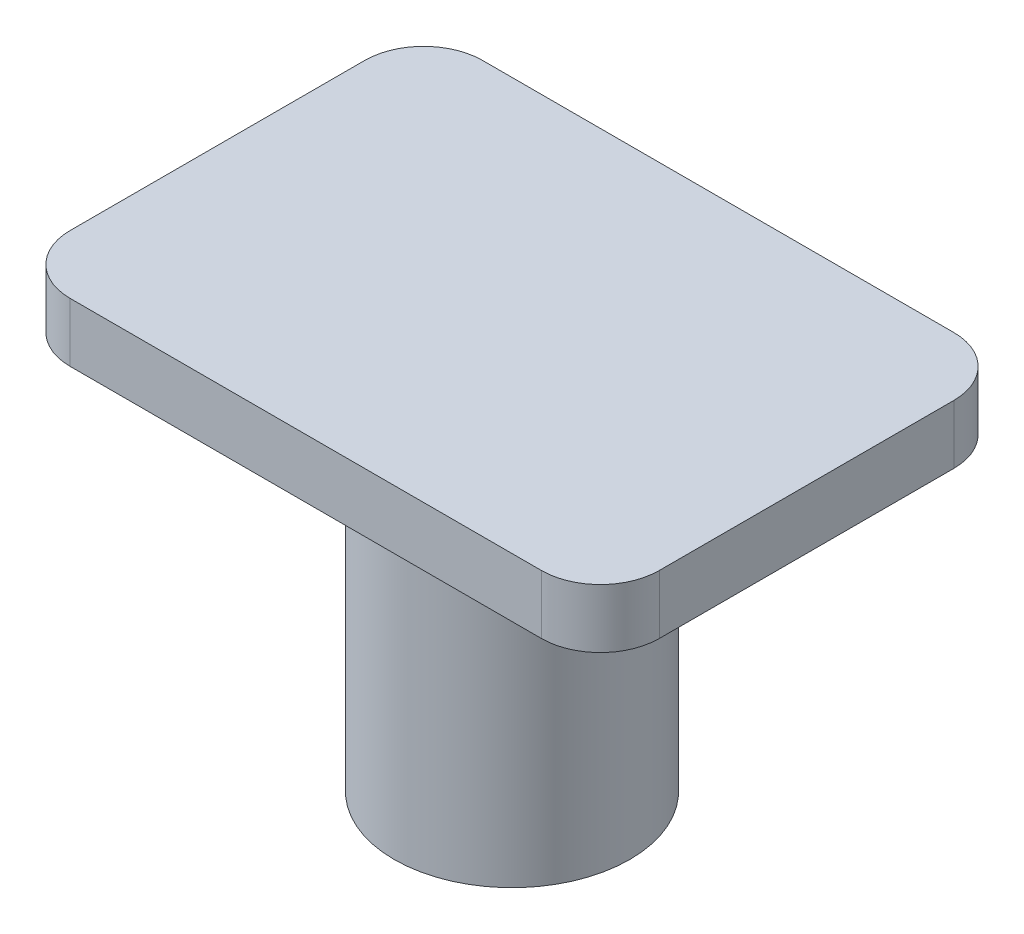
ISO-10303-21;
HEADER;
FILE_DESCRIPTION(('STEP AP214'),'2;1');
FILE_NAME('part.step','',(''),(''),'','','');
FILE_SCHEMA(('AUTOMOTIVE_DESIGN { 1 0 10303 214 1 1 1 1 }'));
ENDSEC;
DATA;
#1=APPLICATION_CONTEXT('core data for automotive mechanical design processes');
#2=APPLICATION_PROTOCOL_DEFINITION('international standard','automotive_design',2000,#1);
#3=PRODUCT_CONTEXT('',#1,'mechanical');
#4=PRODUCT('Part','Part','',(#3));
#5=PRODUCT_RELATED_PRODUCT_CATEGORY('part','',(#4));
#6=PRODUCT_DEFINITION_FORMATION('','',#4);
#7=PRODUCT_DEFINITION_CONTEXT('part definition',#1,'design');
#8=PRODUCT_DEFINITION('design','',#6,#7);
#9=PRODUCT_DEFINITION_SHAPE('','',#8);
#10=(LENGTH_UNIT() NAMED_UNIT(*) SI_UNIT(.MILLI.,.METRE.));
#11=(NAMED_UNIT(*) PLANE_ANGLE_UNIT() SI_UNIT($,.RADIAN.));
#12=(NAMED_UNIT(*) SI_UNIT($,.STERADIAN.) SOLID_ANGLE_UNIT());
#13=UNCERTAINTY_MEASURE_WITH_UNIT(LENGTH_MEASURE(1.E-05),#10,'distance_accuracy_value','');
#14=(GEOMETRIC_REPRESENTATION_CONTEXT(3) GLOBAL_UNCERTAINTY_ASSIGNED_CONTEXT((#13)) GLOBAL_UNIT_ASSIGNED_CONTEXT((#10,
#11,#12)) REPRESENTATION_CONTEXT('',''));
#15=CARTESIAN_POINT('',(0.,0.,0.));
#16=DIRECTION('',(0.,0.,1.));
#17=DIRECTION('',(1.,0.,0.));
#18=AXIS2_PLACEMENT_3D('',#15,#16,#17);
#19=CARTESIAN_POINT('',(0.,0.,0.));
#20=DIRECTION('',(0.,1.,0.));
#21=DIRECTION('',(0.,0.,1.));
#22=AXIS2_PLACEMENT_3D('',#19,#20,#21);
#23=PLANE('',#22);
#24=CARTESIAN_POINT('',(0.,0.,0.));
#25=DIRECTION('',(0.,1.,0.));
#26=DIRECTION('',(0.,0.,1.));
#27=AXIS2_PLACEMENT_3D('',#24,#25,#26);
#28=CIRCLE('',#27,10.);
#29=CARTESIAN_POINT('',(0.,0.,10.));
#30=VERTEX_POINT('',#29);
#31=EDGE_CURVE('E154',#30,#30,#28,.T.);
#32=ORIENTED_EDGE('',*,*,#31,.F.);
#33=EDGE_LOOP('',(#32));
#34=FACE_BOUND('',#33,.T.);
#35=CARTESIAN_POINT('',(0.,0.,0.));
#36=DIRECTION('',(0.,1.,0.));
#37=DIRECTION('',(1.,0.,0.));
#38=AXIS2_PLACEMENT_3D('',#35,#36,#37);
#39=CIRCLE('',#38,8.);
#40=CARTESIAN_POINT('',(8.,0.,0.));
#41=VERTEX_POINT('',#40);
#42=EDGE_CURVE('E151',#41,#41,#39,.T.);
#43=ORIENTED_EDGE('',*,*,#42,.T.);
#44=EDGE_LOOP('',(#43));
#45=FACE_BOUND('',#44,.T.);
#46=ADVANCED_FACE('F39',(#34,#45),#23,.F.);
#47=CARTESIAN_POINT('',(0.,30.,0.));
#48=DIRECTION('',(0.,-1.,0.));
#49=DIRECTION('',(0.,0.,-1.));
#50=AXIS2_PLACEMENT_3D('',#47,#48,#49);
#51=CYLINDRICAL_SURFACE('',#50,10.);
#52=CARTESIAN_POINT('',(0.,30.,0.));
#53=DIRECTION('',(0.,1.,0.));
#54=DIRECTION('',(0.,0.,1.));
#55=AXIS2_PLACEMENT_3D('',#52,#53,#54);
#56=CIRCLE('',#55,10.);
#57=CARTESIAN_POINT('',(0.,30.,10.));
#58=VERTEX_POINT('',#57);
#59=EDGE_CURVE('E157',#58,#58,#56,.T.);
#60=ORIENTED_EDGE('',*,*,#59,.F.);
#61=EDGE_LOOP('',(#60));
#62=FACE_BOUND('',#61,.T.);
#63=ORIENTED_EDGE('',*,*,#31,.T.);
#64=EDGE_LOOP('',(#63));
#65=FACE_BOUND('',#64,.T.);
#66=ADVANCED_FACE('F41',(#62,#65),#51,.T.);
#67=CARTESIAN_POINT('',(0.,30.,0.));
#68=DIRECTION('',(0.,-1.,0.));
#69=DIRECTION('',(0.,0.,-1.));
#70=AXIS2_PLACEMENT_3D('',#67,#68,#69);
#71=CYLINDRICAL_SURFACE('',#70,8.);
#72=CARTESIAN_POINT('',(0.,30.,0.));
#73=DIRECTION('',(0.,1.,0.));
#74=DIRECTION('',(0.,0.,1.));
#75=AXIS2_PLACEMENT_3D('',#72,#73,#74);
#76=CIRCLE('',#75,8.);
#77=CARTESIAN_POINT('',(0.,30.,8.));
#78=VERTEX_POINT('',#77);
#79=EDGE_CURVE('E148',#78,#78,#76,.T.);
#80=ORIENTED_EDGE('',*,*,#79,.T.);
#81=EDGE_LOOP('',(#80));
#82=FACE_BOUND('',#81,.T.);
#83=ORIENTED_EDGE('',*,*,#42,.F.);
#84=EDGE_LOOP('',(#83));
#85=FACE_BOUND('',#84,.T.);
#86=ADVANCED_FACE('F214',(#82,#85),#71,.F.);
#87=CARTESIAN_POINT('',(-25.,30.,17.5));
#88=DIRECTION('',(0.,1.,0.));
#89=DIRECTION('',(0.,0.,1.));
#90=AXIS2_PLACEMENT_3D('',#87,#88,#89);
#91=PLANE('',#90);
#92=ORIENTED_EDGE('',*,*,#79,.F.);
#93=EDGE_LOOP('',(#92));
#94=FACE_BOUND('',#93,.T.);
#95=ADVANCED_FACE('F221',(#94),#91,.F.);
#96=DIRECTION('',(-1.,0.,0.));
#97=VECTOR('',#96,1.);
#98=CARTESIAN_POINT('',(-25.,30.,-17.5));
#99=LINE('',#98,#97);
#100=CARTESIAN_POINT('',(20.,30.,-17.5));
#101=VERTEX_POINT('',#100);
#102=CARTESIAN_POINT('',(-20.,30.,-17.5));
#103=VERTEX_POINT('',#102);
#104=EDGE_CURVE('E123',#101,#103,#99,.T.);
#105=ORIENTED_EDGE('',*,*,#104,.F.);
#106=CARTESIAN_POINT('',(20.,30.,-12.5));
#107=DIRECTION('',(0.,1.,0.));
#108=DIRECTION('',(0.,0.,1.));
#109=AXIS2_PLACEMENT_3D('',#106,#107,#108);
#110=CIRCLE('',#109,5.);
#111=CARTESIAN_POINT('',(25.,30.,-12.5));
#112=VERTEX_POINT('',#111);
#113=EDGE_CURVE('E106',#101,#112,#110,.F.);
#114=ORIENTED_EDGE('',*,*,#113,.T.);
#115=DIRECTION('',(0.,0.,-1.));
#116=VECTOR('',#115,1.);
#117=CARTESIAN_POINT('',(25.,30.,-17.5));
#118=LINE('',#117,#116);
#119=CARTESIAN_POINT('',(25.,30.,12.5));
#120=VERTEX_POINT('',#119);
#121=EDGE_CURVE('E135',#120,#112,#118,.T.);
#122=ORIENTED_EDGE('',*,*,#121,.F.);
#123=CARTESIAN_POINT('',(20.,30.,12.5));
#124=DIRECTION('',(0.,1.,0.));
#125=DIRECTION('',(0.,0.,1.));
#126=AXIS2_PLACEMENT_3D('',#123,#124,#125);
#127=CIRCLE('',#126,5.);
#128=CARTESIAN_POINT('',(20.,30.,17.5));
#129=VERTEX_POINT('',#128);
#130=EDGE_CURVE('E117',#120,#129,#127,.F.);
#131=ORIENTED_EDGE('',*,*,#130,.T.);
#132=DIRECTION('',(1.,0.,0.));
#133=VECTOR('',#132,1.);
#134=CARTESIAN_POINT('',(-25.,30.,17.5));
#135=LINE('',#134,#133);
#136=CARTESIAN_POINT('',(-20.,30.,17.5));
#137=VERTEX_POINT('',#136);
#138=EDGE_CURVE('E139',#137,#129,#135,.T.);
#139=ORIENTED_EDGE('',*,*,#138,.F.);
#140=CARTESIAN_POINT('',(-20.,30.,12.5));
#141=DIRECTION('',(0.,1.,0.));
#142=DIRECTION('',(0.,0.,1.));
#143=AXIS2_PLACEMENT_3D('',#140,#141,#142);
#144=CIRCLE('',#143,5.);
#145=CARTESIAN_POINT('',(-25.,30.,12.5));
#146=VERTEX_POINT('',#145);
#147=EDGE_CURVE('E127',#137,#146,#144,.F.);
#148=ORIENTED_EDGE('',*,*,#147,.T.);
#149=DIRECTION('',(0.,0.,1.));
#150=VECTOR('',#149,1.);
#151=CARTESIAN_POINT('',(-25.,30.,-17.5));
#152=LINE('',#151,#150);
#153=CARTESIAN_POINT('',(-25.,30.,-12.5));
#154=VERTEX_POINT('',#153);
#155=EDGE_CURVE('E183',#154,#146,#152,.T.);
#156=ORIENTED_EDGE('',*,*,#155,.F.);
#157=CARTESIAN_POINT('',(-20.,30.,-12.5));
#158=DIRECTION('',(0.,1.,0.));
#159=DIRECTION('',(0.,0.,1.));
#160=AXIS2_PLACEMENT_3D('',#157,#158,#159);
#161=CIRCLE('',#160,5.);
#162=EDGE_CURVE('E133',#154,#103,#161,.F.);
#163=ORIENTED_EDGE('',*,*,#162,.T.);
#164=EDGE_LOOP('',(#105,#114,#122,#131,#139,#148,#156,#163));
#165=FACE_BOUND('',#164,.T.);
#166=ORIENTED_EDGE('',*,*,#59,.T.);
#167=EDGE_LOOP('',(#166));
#168=FACE_BOUND('',#167,.T.);
#169=ADVANCED_FACE('F130',(#165,#168),#91,.F.);
#170=CARTESIAN_POINT('',(-25.,35.,-17.5));
#171=DIRECTION('',(1.,0.,0.));
#172=DIRECTION('',(0.,0.,-1.));
#173=AXIS2_PLACEMENT_3D('',#170,#171,#172);
#174=PLANE('',#173);
#175=DIRECTION('',(0.,0.,1.));
#176=VECTOR('',#175,1.);
#177=CARTESIAN_POINT('',(-25.,35.,-17.5));
#178=LINE('',#177,#176);
#179=CARTESIAN_POINT('',(-25.,35.,-12.5));
#180=VERTEX_POINT('',#179);
#181=CARTESIAN_POINT('',(-25.,35.,12.5));
#182=VERTEX_POINT('',#181);
#183=EDGE_CURVE('E134',#180,#182,#178,.T.);
#184=ORIENTED_EDGE('',*,*,#183,.F.);
#185=DIRECTION('',(0.,-1.,0.));
#186=VECTOR('',#185,1.);
#187=CARTESIAN_POINT('',(-25.,35.,-12.5));
#188=LINE('',#187,#186);
#189=EDGE_CURVE('E12',#180,#154,#188,.T.);
#190=ORIENTED_EDGE('',*,*,#189,.T.);
#191=ORIENTED_EDGE('',*,*,#155,.T.);
#192=DIRECTION('',(0.,-1.,0.));
#193=VECTOR('',#192,1.);
#194=CARTESIAN_POINT('',(-25.,35.,12.5));
#195=LINE('',#194,#193);
#196=EDGE_CURVE('E47',#146,#182,#195,.F.);
#197=ORIENTED_EDGE('',*,*,#196,.T.);
#198=EDGE_LOOP('',(#184,#190,#191,#197));
#199=FACE_BOUND('',#198,.T.);
#200=ADVANCED_FACE('F181',(#199),#174,.F.);
#201=CARTESIAN_POINT('',(-25.,35.,17.5));
#202=DIRECTION('',(0.,0.,-1.));
#203=DIRECTION('',(-1.,0.,0.));
#204=AXIS2_PLACEMENT_3D('',#201,#202,#203);
#205=PLANE('',#204);
#206=ORIENTED_EDGE('',*,*,#138,.T.);
#207=DIRECTION('',(0.,-1.,0.));
#208=VECTOR('',#207,1.);
#209=CARTESIAN_POINT('',(20.,35.,17.5));
#210=LINE('',#209,#208);
#211=CARTESIAN_POINT('',(20.,35.,17.5));
#212=VERTEX_POINT('',#211);
#213=EDGE_CURVE('E54',#129,#212,#210,.F.);
#214=ORIENTED_EDGE('',*,*,#213,.T.);
#215=DIRECTION('',(1.,0.,0.));
#216=VECTOR('',#215,1.);
#217=CARTESIAN_POINT('',(-25.,35.,17.5));
#218=LINE('',#217,#216);
#219=CARTESIAN_POINT('',(-20.,35.,17.5));
#220=VERTEX_POINT('',#219);
#221=EDGE_CURVE('E137',#220,#212,#218,.T.);
#222=ORIENTED_EDGE('',*,*,#221,.F.);
#223=DIRECTION('',(0.,-1.,0.));
#224=VECTOR('',#223,1.);
#225=CARTESIAN_POINT('',(-20.,35.,17.5));
#226=LINE('',#225,#224);
#227=EDGE_CURVE('E174',#220,#137,#226,.T.);
#228=ORIENTED_EDGE('',*,*,#227,.T.);
#229=EDGE_LOOP('',(#206,#214,#222,#228));
#230=FACE_BOUND('',#229,.T.);
#231=ADVANCED_FACE('F190',(#230),#205,.F.);
#232=CARTESIAN_POINT('',(25.,35.,-17.5));
#233=DIRECTION('',(-1.,0.,0.));
#234=DIRECTION('',(0.,0.,1.));
#235=AXIS2_PLACEMENT_3D('',#232,#233,#234);
#236=PLANE('',#235);
#237=ORIENTED_EDGE('',*,*,#121,.T.);
#238=DIRECTION('',(0.,-1.,0.));
#239=VECTOR('',#238,1.);
#240=CARTESIAN_POINT('',(25.,35.,-12.5));
#241=LINE('',#240,#239);
#242=CARTESIAN_POINT('',(25.,35.,-12.5));
#243=VERTEX_POINT('',#242);
#244=EDGE_CURVE('E111',#112,#243,#241,.F.);
#245=ORIENTED_EDGE('',*,*,#244,.T.);
#246=DIRECTION('',(0.,0.,-1.));
#247=VECTOR('',#246,1.);
#248=CARTESIAN_POINT('',(25.,35.,-17.5));
#249=LINE('',#248,#247);
#250=CARTESIAN_POINT('',(25.,35.,12.5));
#251=VERTEX_POINT('',#250);
#252=EDGE_CURVE('E144',#251,#243,#249,.T.);
#253=ORIENTED_EDGE('',*,*,#252,.F.);
#254=DIRECTION('',(0.,-1.,0.));
#255=VECTOR('',#254,1.);
#256=CARTESIAN_POINT('',(25.,35.,12.5));
#257=LINE('',#256,#255);
#258=EDGE_CURVE('E116',#251,#120,#257,.T.);
#259=ORIENTED_EDGE('',*,*,#258,.T.);
#260=EDGE_LOOP('',(#237,#245,#253,#259));
#261=FACE_BOUND('',#260,.T.);
#262=ADVANCED_FACE('F198',(#261),#236,.F.);
#263=CARTESIAN_POINT('',(-25.,35.,-17.5));
#264=DIRECTION('',(0.,0.,1.));
#265=DIRECTION('',(1.,0.,0.));
#266=AXIS2_PLACEMENT_3D('',#263,#264,#265);
#267=PLANE('',#266);
#268=DIRECTION('',(-1.,0.,0.));
#269=VECTOR('',#268,1.);
#270=CARTESIAN_POINT('',(-25.,35.,-17.5));
#271=LINE('',#270,#269);
#272=CARTESIAN_POINT('',(20.,35.,-17.5));
#273=VERTEX_POINT('',#272);
#274=CARTESIAN_POINT('',(-20.,35.,-17.5));
#275=VERTEX_POINT('',#274);
#276=EDGE_CURVE('E126',#273,#275,#271,.T.);
#277=ORIENTED_EDGE('',*,*,#276,.F.);
#278=DIRECTION('',(0.,-1.,0.));
#279=VECTOR('',#278,1.);
#280=CARTESIAN_POINT('',(20.,35.,-17.5));
#281=LINE('',#280,#279);
#282=EDGE_CURVE('E110',#273,#101,#281,.T.);
#283=ORIENTED_EDGE('',*,*,#282,.T.);
#284=ORIENTED_EDGE('',*,*,#104,.T.);
#285=DIRECTION('',(0.,-1.,0.));
#286=VECTOR('',#285,1.);
#287=CARTESIAN_POINT('',(-20.,35.,-17.5));
#288=LINE('',#287,#286);
#289=EDGE_CURVE('E128',#103,#275,#288,.F.);
#290=ORIENTED_EDGE('',*,*,#289,.T.);
#291=EDGE_LOOP('',(#277,#283,#284,#290));
#292=FACE_BOUND('',#291,.T.);
#293=ADVANCED_FACE('F122',(#292),#267,.F.);
#294=CARTESIAN_POINT('',(-25.,35.,17.5));
#295=DIRECTION('',(0.,1.,0.));
#296=DIRECTION('',(0.,0.,1.));
#297=AXIS2_PLACEMENT_3D('',#294,#295,#296);
#298=PLANE('',#297);
#299=ORIENTED_EDGE('',*,*,#252,.T.);
#300=CARTESIAN_POINT('',(20.,35.,-12.5));
#301=DIRECTION('',(0.,1.,0.));
#302=DIRECTION('',(0.,0.,1.));
#303=AXIS2_PLACEMENT_3D('',#300,#301,#302);
#304=CIRCLE('',#303,5.);
#305=EDGE_CURVE('E172',#243,#273,#304,.T.);
#306=ORIENTED_EDGE('',*,*,#305,.T.);
#307=ORIENTED_EDGE('',*,*,#276,.T.);
#308=CARTESIAN_POINT('',(-20.,35.,-12.5));
#309=DIRECTION('',(0.,1.,0.));
#310=DIRECTION('',(0.,0.,1.));
#311=AXIS2_PLACEMENT_3D('',#308,#309,#310);
#312=CIRCLE('',#311,5.);
#313=EDGE_CURVE('E168',#275,#180,#312,.T.);
#314=ORIENTED_EDGE('',*,*,#313,.T.);
#315=ORIENTED_EDGE('',*,*,#183,.T.);
#316=CARTESIAN_POINT('',(-20.,35.,12.5));
#317=DIRECTION('',(0.,1.,0.));
#318=DIRECTION('',(0.,0.,1.));
#319=AXIS2_PLACEMENT_3D('',#316,#317,#318);
#320=CIRCLE('',#319,5.);
#321=EDGE_CURVE('E61',#182,#220,#320,.T.);
#322=ORIENTED_EDGE('',*,*,#321,.T.);
#323=ORIENTED_EDGE('',*,*,#221,.T.);
#324=CARTESIAN_POINT('',(20.,35.,12.5));
#325=DIRECTION('',(0.,1.,0.));
#326=DIRECTION('',(0.,0.,1.));
#327=AXIS2_PLACEMENT_3D('',#324,#325,#326);
#328=CIRCLE('',#327,5.);
#329=EDGE_CURVE('E170',#212,#251,#328,.T.);
#330=ORIENTED_EDGE('',*,*,#329,.T.);
#331=EDGE_LOOP('',(#299,#306,#307,#314,#315,#322,#323,#330));
#332=FACE_BOUND('',#331,.T.);
#333=ADVANCED_FACE('F185',(#332),#298,.T.);
#334=CARTESIAN_POINT('',(20.,35.,-12.5));
#335=DIRECTION('',(0.,-1.,0.));
#336=DIRECTION('',(0.,0.,-1.));
#337=AXIS2_PLACEMENT_3D('',#334,#335,#336);
#338=CYLINDRICAL_SURFACE('',#337,5.);
#339=ORIENTED_EDGE('',*,*,#305,.F.);
#340=ORIENTED_EDGE('',*,*,#244,.F.);
#341=ORIENTED_EDGE('',*,*,#113,.F.);
#342=ORIENTED_EDGE('',*,*,#282,.F.);
#343=EDGE_LOOP('',(#339,#340,#341,#342));
#344=FACE_BOUND('',#343,.T.);
#345=ADVANCED_FACE('F109',(#344),#338,.T.);
#346=CARTESIAN_POINT('',(20.,35.,12.5));
#347=DIRECTION('',(0.,-1.,0.));
#348=DIRECTION('',(0.,0.,-1.));
#349=AXIS2_PLACEMENT_3D('',#346,#347,#348);
#350=CYLINDRICAL_SURFACE('',#349,5.);
#351=ORIENTED_EDGE('',*,*,#329,.F.);
#352=ORIENTED_EDGE('',*,*,#213,.F.);
#353=ORIENTED_EDGE('',*,*,#130,.F.);
#354=ORIENTED_EDGE('',*,*,#258,.F.);
#355=EDGE_LOOP('',(#351,#352,#353,#354));
#356=FACE_BOUND('',#355,.T.);
#357=ADVANCED_FACE('F195',(#356),#350,.T.);
#358=CARTESIAN_POINT('',(-20.,35.,-12.5));
#359=DIRECTION('',(0.,-1.,0.));
#360=DIRECTION('',(0.,0.,-1.));
#361=AXIS2_PLACEMENT_3D('',#358,#359,#360);
#362=CYLINDRICAL_SURFACE('',#361,5.);
#363=ORIENTED_EDGE('',*,*,#313,.F.);
#364=ORIENTED_EDGE('',*,*,#289,.F.);
#365=ORIENTED_EDGE('',*,*,#162,.F.);
#366=ORIENTED_EDGE('',*,*,#189,.F.);
#367=EDGE_LOOP('',(#363,#364,#365,#366));
#368=FACE_BOUND('',#367,.T.);
#369=ADVANCED_FACE('F200',(#368),#362,.T.);
#370=CARTESIAN_POINT('',(-20.,35.,12.5));
#371=DIRECTION('',(0.,-1.,0.));
#372=DIRECTION('',(0.,0.,-1.));
#373=AXIS2_PLACEMENT_3D('',#370,#371,#372);
#374=CYLINDRICAL_SURFACE('',#373,5.);
#375=ORIENTED_EDGE('',*,*,#321,.F.);
#376=ORIENTED_EDGE('',*,*,#196,.F.);
#377=ORIENTED_EDGE('',*,*,#147,.F.);
#378=ORIENTED_EDGE('',*,*,#227,.F.);
#379=EDGE_LOOP('',(#375,#376,#377,#378));
#380=FACE_BOUND('',#379,.T.);
#381=ADVANCED_FACE('F188',(#380),#374,.T.);
#382=CLOSED_SHELL('',(#46,#66,#86,#95,#169,#200,#231,#262,#293,#333,#345,#357,#369,#381));
#383=MANIFOLD_SOLID_BREP('B2',#382);
#384=ADVANCED_BREP_SHAPE_REPRESENTATION('',(#18,#383),#14);
#385=SHAPE_DEFINITION_REPRESENTATION(#9,#384);
ENDSEC;
END-ISO-10303-21;
